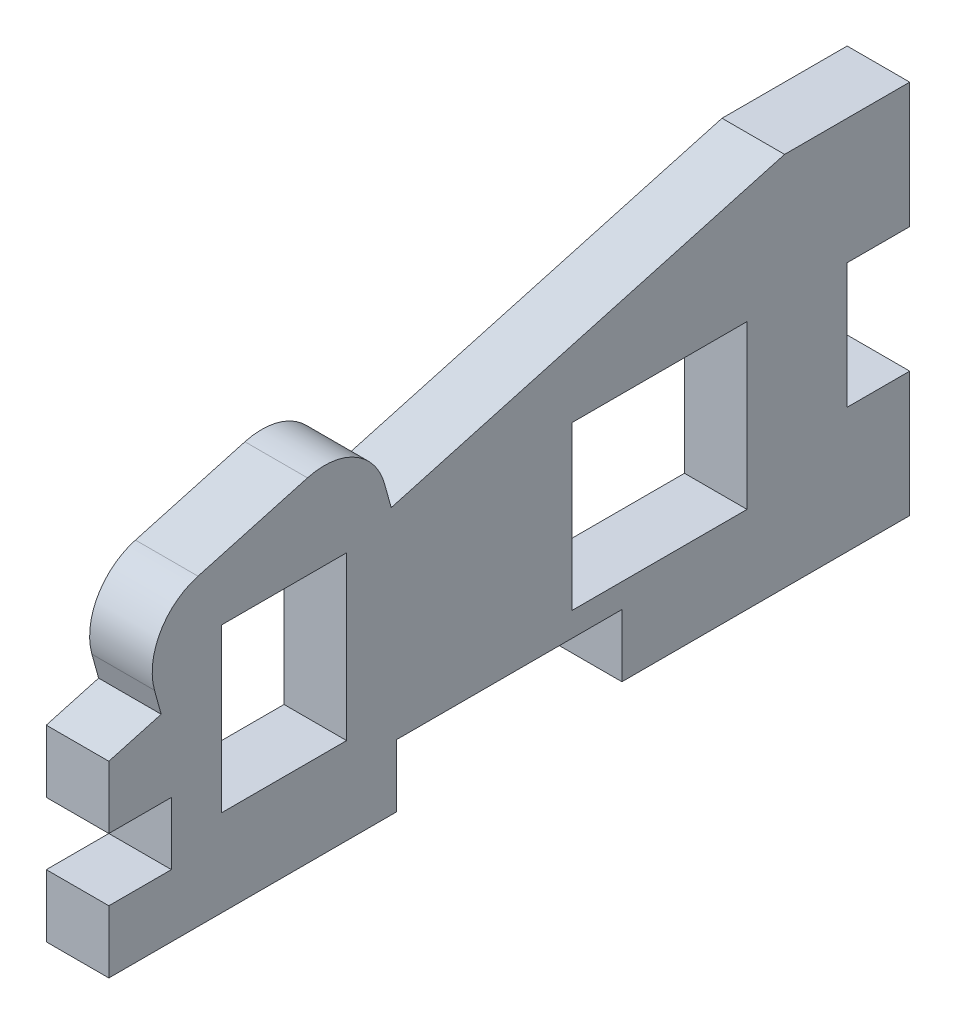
from build123d import *

# Parameters (mm, degrees)
BOSS_EXTRU_1_DEPTH           = 5
ESQUISSE3_W                  = 5
ESQUISSE3_H                  = 10
BOSS_EXTRU_2_DEPTH           = 5
ENL_V_MAT_EXTRU_1_DEPTH      = 49.892171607
ENL_V_MAT_EXTRU_1_DEPTH_BACK = 49.892171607
ESQUISSE4_W                  = 18
ESQUISSE4_H                  = 5
ESQUISSE4_W_2                = 5
ENL_V_MAT_EXTRU_2_DEPTH      = 49.892171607
ENL_V_MAT_EXTRU_2_DEPTH_BACK = 49.892171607
ESQUISSE6_W                  = 14
ESQUISSE6_H                  = 13
ESQUISSE6_W_2                = 10
BOSS_EXTRU_3_DEPTH           = 5
CONG_1_R                     = 5


with BuildPart() as part:
    # Esquisse1 → Boss.-Extru.1 (new body)
    with BuildSketch(Plane(origin=(0, 0, 0), x_dir=(0, 0, -1), z_dir=(1, 0, 0))):
        Polygon((-19.666666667, 5), (-19.666666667, -10), (39.333333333, -10), (39.333333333, 20), (34.333333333, 20), align=None)
    extrude(amount=BOSS_EXTRU_1_DEPTH)

    # Esquisse3 → Boss.-Extru.2 (add)
    with BuildSketch(Plane(origin=(5, 0, 0), x_dir=(0, 0, -1), z_dir=(1, 0, 0))):
        with Locations((41.833333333, 15)):
            Rectangle(ESQUISSE3_W, ESQUISSE3_H)
        with Locations((41.833333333, -5)):
            Rectangle(ESQUISSE3_W, ESQUISSE3_H)
    extrude(amount=-BOSS_EXTRU_2_DEPTH)

    # Esquisse4 → Enl_v. mat.-Extru.1 (cut, two sides: drawn at the far end of the back side and taken through both)
    with BuildSketch(Plane(origin=(5, 0, 0), x_dir=(0, 0, -1), z_dir=(1, 0, 0)).offset(-ENL_V_MAT_EXTRU_1_DEPTH_BACK)):
        with Locations((12.333333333, -7.5)):
            Rectangle(ESQUISSE4_W, ESQUISSE4_H)
        with Locations((-17.166666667, -2.5)):
            Rectangle(ESQUISSE4_W_2, ESQUISSE4_H)
    extrude(amount=ENL_V_MAT_EXTRU_1_DEPTH + ENL_V_MAT_EXTRU_1_DEPTH_BACK, mode=Mode.SUBTRACT)

    # Esquisse6 → Enl_v. mat.-Extru.2 (cut, two sides: drawn at the far end of the back side and taken through both)
    with BuildSketch(Plane(origin=(5, 0, 0), x_dir=(0, 0, -1), z_dir=(1, 0, 0)).offset(-ENL_V_MAT_EXTRU_2_DEPTH_BACK)):
        with Locations((24.333333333, 3.43)):
            Rectangle(ESQUISSE6_W, ESQUISSE6_H)
        with Locations((-5.666666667, 3.43)):
            Rectangle(ESQUISSE6_W_2, ESQUISSE6_H)
    extrude(amount=ENL_V_MAT_EXTRU_2_DEPTH + ENL_V_MAT_EXTRU_2_DEPTH_BACK, mode=Mode.SUBTRACT)

    # Esquisse7 → Boss.-Extru.3 (add)
    with BuildSketch(Plane(origin=(5, 0, 0), x_dir=(0, 0, -1), z_dir=(1, 0, 0))):
        Polygon((-15.484256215, 6.161780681), (-10.666666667, 7.5), (-10.666666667, 9.93), (-1.918666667, 9.93), (2.898922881, 11.268219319), (1.025415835, 18.012844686), (-17.357763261, 12.906406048), align=None)
    extrude(amount=-BOSS_EXTRU_3_DEPTH)

    # Cong_1
    cong_1_edges = [part.edges().sort_by_distance(p)[0] for p in [
        (2.5, 18.012844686, -1.025415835),
        (2.5, 12.906406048, 17.357763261),
    ]]
    fillet(cong_1_edges, radius=CONG_1_R)


solid = part.part
